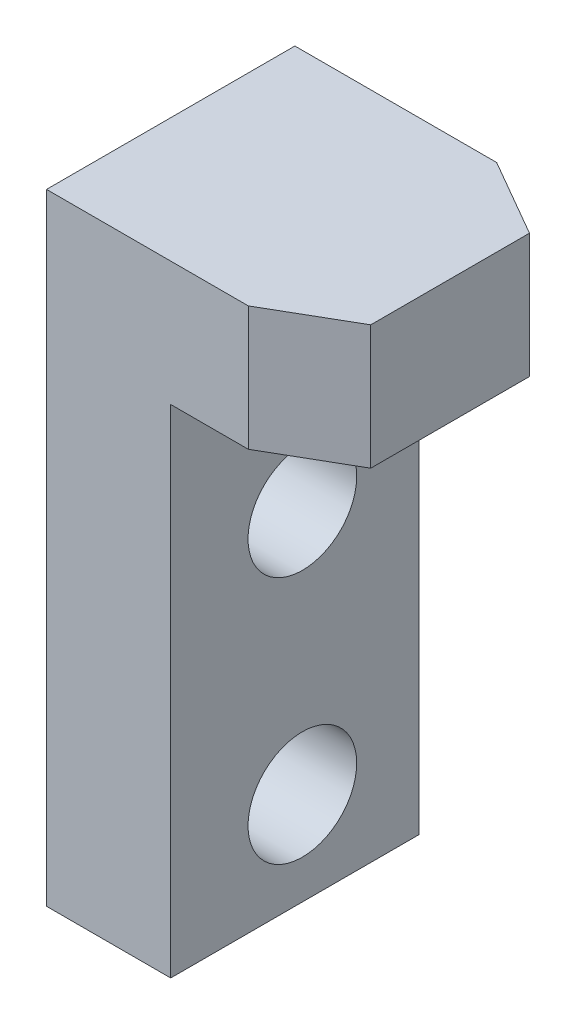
from build123d import *
from OCP.BRepFilletAPI import BRepFilletAPI_MakeChamfer

# Parameters (mm, degrees)
BOSS_EXTRU_1_DEPTH      = 8
CHANFREIN1_SIZE         = 2.5
CHANFREIN1_SIZE2        = 1.443375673
ESQUISSE2_R             = 1.75
ENL_V_MAT_EXTRU_1_DEPTH = 23.113344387


with BuildPart() as part:
    # Esquisse1 → Boss.-Extru.1 (new body)
    with BuildSketch(Plane.XY):
        Polygon((0, 0), (9, 0), (9, -4), (4, -4), (4, -20), (0, -20), align=None)
    extrude(amount=BOSS_EXTRU_1_DEPTH)

    # Chanfrein1: one chamfer whose edges measure the first distance from different faces: ONE call of the kernel's chamfer builder (chamfer() names one face for all edges)
    chanfrein1_edges_1 = [part.edges().sort_by_distance(p)[0] for p in [
        (9, -2, 8),
    ]]
    chanfrein1_side_1 = [part.faces().sort_by_distance(p)[0] for p in [
        (2.9, -8.4, 8),
    ]]
    chanfrein1_edges_2 = [part.edges().sort_by_distance(p)[0] for p in [
        (9, -2, 0),
    ]]
    chanfrein1_side_2 = [part.faces().sort_by_distance(p)[0] for p in [
        (2.9, -8.4, 0),
    ]]
    chanfrein1 = BRepFilletAPI_MakeChamfer(part.part.solid().wrapped)
    for e in chanfrein1_edges_1:
        chanfrein1.Add(CHANFREIN1_SIZE, CHANFREIN1_SIZE2, e.wrapped, chanfrein1_side_1[0].wrapped)  # the first distance lies on this face
    for e in chanfrein1_edges_2:
        chanfrein1.Add(CHANFREIN1_SIZE, CHANFREIN1_SIZE2, e.wrapped, chanfrein1_side_2[0].wrapped)  # the first distance lies on this face
    add(Compound.cast(chanfrein1.Shape()), mode=Mode.REPLACE)

    # Esquisse2 → Enl_v. mat.-Extru.1 (cut, through all)
    with BuildSketch(Plane(origin=(4, 0, 0), x_dir=(0, 0, -1), z_dir=(1, 0, 0))):
        with Locations((-3.758961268, -17)):
            Circle(ESQUISSE2_R)
        with Locations((-3.758961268, -9)):
            Circle(ESQUISSE2_R)
    extrude(amount=-ENL_V_MAT_EXTRU_1_DEPTH, mode=Mode.SUBTRACT)


solid = part.part
